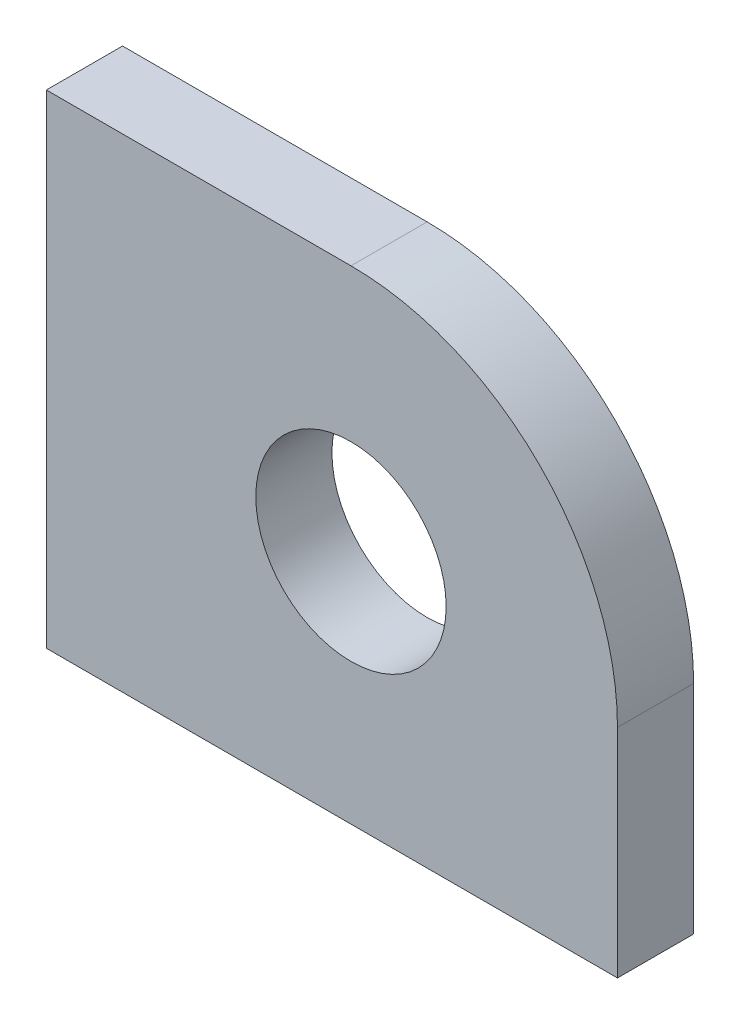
from build123d import *

# Parameters (mm, degrees)
ESQUISSE1_R      = 25
EXTRUSION1_DEPTH = 20


with BuildPart() as part:
    # Esquisse1 → Extrusion1 (new body)
    with BuildSketch(Plane.XY):
        with BuildLine():
            Line((0, 65), (-80, 65))
            Line((-80, 65), (-80, -62))
            Line((-80, -62), (70, -62))
            Line((70, -62), (70, -5))
            ThreePointArc((70, -5), (49.497474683, 44.497474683), (0, 65))
        make_face()
        Circle(ESQUISSE1_R, mode=Mode.SUBTRACT)
    extrude(amount=EXTRUSION1_DEPTH)


solid = part.part
